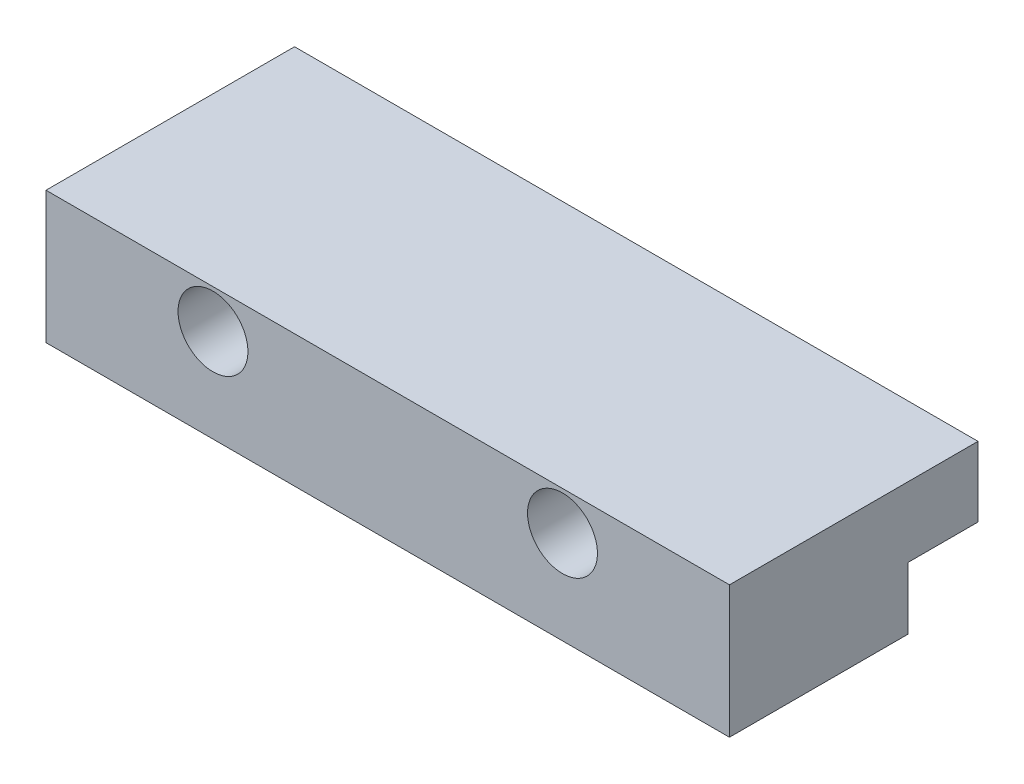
ISO-10303-21;
HEADER;
FILE_DESCRIPTION(('STEP AP214'),'2;1');
FILE_NAME('part.step','',(''),(''),'','','');
FILE_SCHEMA(('AUTOMOTIVE_DESIGN { 1 0 10303 214 1 1 1 1 }'));
ENDSEC;
DATA;
#1=APPLICATION_CONTEXT('core data for automotive mechanical design processes');
#2=APPLICATION_PROTOCOL_DEFINITION('international standard','automotive_design',2000,#1);
#3=PRODUCT_CONTEXT('',#1,'mechanical');
#4=PRODUCT('Part','Part','',(#3));
#5=PRODUCT_RELATED_PRODUCT_CATEGORY('part','',(#4));
#6=PRODUCT_DEFINITION_FORMATION('','',#4);
#7=PRODUCT_DEFINITION_CONTEXT('part definition',#1,'design');
#8=PRODUCT_DEFINITION('design','',#6,#7);
#9=PRODUCT_DEFINITION_SHAPE('','',#8);
#10=(LENGTH_UNIT() NAMED_UNIT(*) SI_UNIT(.MILLI.,.METRE.));
#11=(NAMED_UNIT(*) PLANE_ANGLE_UNIT() SI_UNIT($,.RADIAN.));
#12=(NAMED_UNIT(*) SI_UNIT($,.STERADIAN.) SOLID_ANGLE_UNIT());
#13=UNCERTAINTY_MEASURE_WITH_UNIT(LENGTH_MEASURE(1.E-05),#10,'distance_accuracy_value','');
#14=(GEOMETRIC_REPRESENTATION_CONTEXT(3) GLOBAL_UNCERTAINTY_ASSIGNED_CONTEXT((#13)) GLOBAL_UNIT_ASSIGNED_CONTEXT((#10,
#11,#12)) REPRESENTATION_CONTEXT('',''));
#15=CARTESIAN_POINT('',(0.,0.,0.));
#16=DIRECTION('',(0.,0.,1.));
#17=DIRECTION('',(1.,0.,0.));
#18=AXIS2_PLACEMENT_3D('',#15,#16,#17);
#19=CARTESIAN_POINT('',(-110.,81.25,-40.));
#20=DIRECTION('',(-1.,0.,0.));
#21=DIRECTION('',(0.,-1.,0.));
#22=AXIS2_PLACEMENT_3D('',#19,#20,#21);
#23=PLANE('',#22);
#24=DIRECTION('',(0.,0.,1.));
#25=VECTOR('',#24,1.);
#26=CARTESIAN_POINT('',(-110.000000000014,-21.85,-2.));
#27=LINE('',#26,#25);
#28=CARTESIAN_POINT('',(-110.000000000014,-21.85,-25.));
#29=VERTEX_POINT('',#28);
#30=CARTESIAN_POINT('',(-110.000000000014,-21.85,-2.));
#31=VERTEX_POINT('',#30);
#32=EDGE_CURVE('E97',#29,#31,#27,.T.);
#33=ORIENTED_EDGE('',*,*,#32,.F.);
#34=DIRECTION('',(0.,-1.,0.));
#35=VECTOR('',#34,1.);
#36=CARTESIAN_POINT('',(-110.000000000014,-23.8500000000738,-25.));
#37=LINE('',#36,#35);
#38=CARTESIAN_POINT('',(-110.000000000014,-13.8500000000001,-25.));
#39=VERTEX_POINT('',#38);
#40=EDGE_CURVE('E24',#39,#29,#37,.T.);
#41=ORIENTED_EDGE('',*,*,#40,.F.);
#42=DIRECTION('',(0.,0.,1.));
#43=VECTOR('',#42,1.);
#44=CARTESIAN_POINT('',(-110.000000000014,-13.8500000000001,-25.));
#45=LINE('',#44,#43);
#46=CARTESIAN_POINT('',(-110.000000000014,-13.8500000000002,-34.));
#47=VERTEX_POINT('',#46);
#48=EDGE_CURVE('E100',#47,#39,#45,.T.);
#49=ORIENTED_EDGE('',*,*,#48,.F.);
#50=DIRECTION('',(0.,-1.,0.));
#51=VECTOR('',#50,1.);
#52=CARTESIAN_POINT('',(-110.000000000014,-15.8500000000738,-34.));
#53=LINE('',#52,#51);
#54=CARTESIAN_POINT('',(-110.000000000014,-4.85000000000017,-34.));
#55=VERTEX_POINT('',#54);
#56=EDGE_CURVE('E98',#55,#47,#53,.T.);
#57=ORIENTED_EDGE('',*,*,#56,.F.);
#58=DIRECTION('',(0.,0.,-1.));
#59=VECTOR('',#58,1.);
#60=CARTESIAN_POINT('',(-110.000000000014,-4.85000000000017,-34.));
#61=LINE('',#60,#59);
#62=CARTESIAN_POINT('',(-110.000000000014,-4.85000000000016,-2.));
#63=VERTEX_POINT('',#62);
#64=EDGE_CURVE('E96',#63,#55,#61,.T.);
#65=ORIENTED_EDGE('',*,*,#64,.F.);
#66=DIRECTION('',(0.,1.,0.));
#67=VECTOR('',#66,1.);
#68=CARTESIAN_POINT('',(-110.000000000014,-3.85000000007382,-2.));
#69=LINE('',#68,#67);
#70=EDGE_CURVE('E71',#31,#63,#69,.T.);
#71=ORIENTED_EDGE('',*,*,#70,.F.);
#72=EDGE_LOOP('',(#33,#41,#49,#57,#65,#71));
#73=FACE_BOUND('',#72,.T.);
#74=ADVANCED_FACE('F16',(#73),#23,.F.);
#75=CARTESIAN_POINT('',(494802.,-13.8500000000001,-25.));
#76=DIRECTION('',(0.,1.,0.));
#77=DIRECTION('',(0.,0.,1.));
#78=AXIS2_PLACEMENT_3D('',#75,#76,#77);
#79=PLANE('',#78);
#80=DIRECTION('',(-1.,0.,0.));
#81=VECTOR('',#80,1.);
#82=CARTESIAN_POINT('',(494802.,-13.8500000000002,-34.));
#83=LINE('',#82,#81);
#84=CARTESIAN_POINT('',(-198.,-13.8500000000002,-34.));
#85=VERTEX_POINT('',#84);
#86=EDGE_CURVE('E128',#47,#85,#83,.T.);
#87=ORIENTED_EDGE('',*,*,#86,.F.);
#88=ORIENTED_EDGE('',*,*,#48,.T.);
#89=DIRECTION('',(-1.,0.,0.));
#90=VECTOR('',#89,1.);
#91=CARTESIAN_POINT('',(494802.,-13.8500000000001,-25.));
#92=LINE('',#91,#90);
#93=CARTESIAN_POINT('',(-198.,-13.8500000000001,-25.));
#94=VERTEX_POINT('',#93);
#95=EDGE_CURVE('E132',#39,#94,#92,.T.);
#96=ORIENTED_EDGE('',*,*,#95,.T.);
#97=DIRECTION('',(0.,0.,-1.));
#98=VECTOR('',#97,1.);
#99=CARTESIAN_POINT('',(-198.,-13.8500000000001,-25.));
#100=LINE('',#99,#98);
#101=EDGE_CURVE('E134',#94,#85,#100,.T.);
#102=ORIENTED_EDGE('',*,*,#101,.T.);
#103=EDGE_LOOP('',(#87,#88,#96,#102));
#104=FACE_BOUND('',#103,.T.);
#105=ADVANCED_FACE('F18',(#104),#79,.F.);
#106=CARTESIAN_POINT('',(494802.,-15.85,-34.));
#107=DIRECTION('',(0.,0.,1.));
#108=DIRECTION('',(1.,0.,0.));
#109=AXIS2_PLACEMENT_3D('',#106,#107,#108);
#110=PLANE('',#109);
#111=CARTESIAN_POINT('',(-176.5,-9.85000000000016,-34.));
#112=DIRECTION('',(0.,0.,1.));
#113=DIRECTION('',(1.,0.,0.));
#114=AXIS2_PLACEMENT_3D('',#111,#112,#113);
#115=CIRCLE('',#114,2.75);
#116=CARTESIAN_POINT('',(-173.75,-9.85000000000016,-34.));
#117=VERTEX_POINT('',#116);
#118=EDGE_CURVE('E113',#117,#117,#115,.T.);
#119=ORIENTED_EDGE('',*,*,#118,.T.);
#120=EDGE_LOOP('',(#119));
#121=FACE_BOUND('',#120,.T.);
#122=CARTESIAN_POINT('',(-131.5,-9.85000000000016,-34.));
#123=DIRECTION('',(0.,0.,1.));
#124=DIRECTION('',(1.,0.,0.));
#125=AXIS2_PLACEMENT_3D('',#122,#123,#124);
#126=CIRCLE('',#125,2.75);
#127=CARTESIAN_POINT('',(-128.75,-9.85000000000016,-34.));
#128=VERTEX_POINT('',#127);
#129=EDGE_CURVE('E105',#128,#128,#126,.T.);
#130=ORIENTED_EDGE('',*,*,#129,.T.);
#131=EDGE_LOOP('',(#130));
#132=FACE_BOUND('',#131,.T.);
#133=DIRECTION('',(-1.,0.,0.));
#134=VECTOR('',#133,1.);
#135=CARTESIAN_POINT('',(494802.,-4.85000000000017,-34.));
#136=LINE('',#135,#134);
#137=CARTESIAN_POINT('',(-198.,-4.85000000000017,-34.));
#138=VERTEX_POINT('',#137);
#139=EDGE_CURVE('E74',#55,#138,#136,.T.);
#140=ORIENTED_EDGE('',*,*,#139,.F.);
#141=ORIENTED_EDGE('',*,*,#56,.T.);
#142=ORIENTED_EDGE('',*,*,#86,.T.);
#143=DIRECTION('',(0.,1.,0.));
#144=VECTOR('',#143,1.);
#145=CARTESIAN_POINT('',(-198.,-15.85,-34.));
#146=LINE('',#145,#144);
#147=EDGE_CURVE('E84',#85,#138,#146,.T.);
#148=ORIENTED_EDGE('',*,*,#147,.T.);
#149=EDGE_LOOP('',(#140,#141,#142,#148));
#150=FACE_BOUND('',#149,.T.);
#151=ADVANCED_FACE('F149',(#121,#132,#150),#110,.F.);
#152=CARTESIAN_POINT('',(494802.,-4.85000000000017,-34.));
#153=DIRECTION('',(0.,-1.,0.));
#154=DIRECTION('',(0.,0.,-1.));
#155=AXIS2_PLACEMENT_3D('',#152,#153,#154);
#156=PLANE('',#155);
#157=DIRECTION('',(-1.,0.,0.));
#158=VECTOR('',#157,1.);
#159=CARTESIAN_POINT('',(494802.,-4.85000000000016,-2.));
#160=LINE('',#159,#158);
#161=CARTESIAN_POINT('',(-198.,-4.85000000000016,-2.));
#162=VERTEX_POINT('',#161);
#163=EDGE_CURVE('E64',#63,#162,#160,.T.);
#164=ORIENTED_EDGE('',*,*,#163,.F.);
#165=ORIENTED_EDGE('',*,*,#64,.T.);
#166=ORIENTED_EDGE('',*,*,#139,.T.);
#167=DIRECTION('',(0.,0.,1.));
#168=VECTOR('',#167,1.);
#169=CARTESIAN_POINT('',(-198.,-4.85000000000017,-34.));
#170=LINE('',#169,#168);
#171=EDGE_CURVE('E78',#138,#162,#170,.T.);
#172=ORIENTED_EDGE('',*,*,#171,.T.);
#173=EDGE_LOOP('',(#164,#165,#166,#172));
#174=FACE_BOUND('',#173,.T.);
#175=ADVANCED_FACE('F79',(#174),#156,.F.);
#176=CARTESIAN_POINT('',(-198.,-15.85,-25.));
#177=DIRECTION('',(-1.,0.,0.));
#178=DIRECTION('',(0.,0.,1.));
#179=AXIS2_PLACEMENT_3D('',#176,#177,#178);
#180=PLANE('',#179);
#181=DIRECTION('',(0.,1.,0.));
#182=VECTOR('',#181,1.);
#183=CARTESIAN_POINT('',(-198.,-23.85,-25.));
#184=LINE('',#183,#182);
#185=CARTESIAN_POINT('',(-198.,-21.85,-25.));
#186=VERTEX_POINT('',#185);
#187=EDGE_CURVE('E109',#186,#94,#184,.T.);
#188=ORIENTED_EDGE('',*,*,#187,.F.);
#189=DIRECTION('',(0.,0.,-1.));
#190=VECTOR('',#189,1.);
#191=CARTESIAN_POINT('',(-198.,-21.85,-2.));
#192=LINE('',#191,#190);
#193=CARTESIAN_POINT('',(-198.,-21.85,-2.));
#194=VERTEX_POINT('',#193);
#195=EDGE_CURVE('E88',#194,#186,#192,.T.);
#196=ORIENTED_EDGE('',*,*,#195,.F.);
#197=DIRECTION('',(0.,-1.,0.));
#198=VECTOR('',#197,1.);
#199=CARTESIAN_POINT('',(-198.,-3.85000000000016,-2.));
#200=LINE('',#199,#198);
#201=EDGE_CURVE('E69',#162,#194,#200,.T.);
#202=ORIENTED_EDGE('',*,*,#201,.F.);
#203=ORIENTED_EDGE('',*,*,#171,.F.);
#204=ORIENTED_EDGE('',*,*,#147,.F.);
#205=ORIENTED_EDGE('',*,*,#101,.F.);
#206=EDGE_LOOP('',(#188,#196,#202,#203,#204,#205));
#207=FACE_BOUND('',#206,.T.);
#208=ADVANCED_FACE('F87',(#207),#180,.T.);
#209=CARTESIAN_POINT('',(494802.,-3.85000000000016,-2.));
#210=DIRECTION('',(0.,0.,-1.));
#211=DIRECTION('',(-1.,0.,0.));
#212=AXIS2_PLACEMENT_3D('',#209,#210,#211);
#213=PLANE('',#212);
#214=CARTESIAN_POINT('',(-176.5,-9.85000000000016,-2.));
#215=DIRECTION('',(0.,0.,-1.));
#216=DIRECTION('',(-1.,0.,0.));
#217=AXIS2_PLACEMENT_3D('',#214,#215,#216);
#218=CIRCLE('',#217,4.5);
#219=CARTESIAN_POINT('',(-181.,-9.85000000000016,-2.));
#220=VERTEX_POINT('',#219);
#221=EDGE_CURVE('E124',#220,#220,#218,.T.);
#222=ORIENTED_EDGE('',*,*,#221,.T.);
#223=EDGE_LOOP('',(#222));
#224=FACE_BOUND('',#223,.T.);
#225=CARTESIAN_POINT('',(-131.5,-9.85000000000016,-2.));
#226=DIRECTION('',(0.,0.,-1.));
#227=DIRECTION('',(-1.,0.,0.));
#228=AXIS2_PLACEMENT_3D('',#225,#226,#227);
#229=CIRCLE('',#228,4.5);
#230=CARTESIAN_POINT('',(-136.,-9.85000000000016,-2.));
#231=VERTEX_POINT('',#230);
#232=EDGE_CURVE('E117',#231,#231,#229,.T.);
#233=ORIENTED_EDGE('',*,*,#232,.T.);
#234=EDGE_LOOP('',(#233));
#235=FACE_BOUND('',#234,.T.);
#236=DIRECTION('',(-1.,0.,0.));
#237=VECTOR('',#236,1.);
#238=CARTESIAN_POINT('',(494802.,-21.85,-2.));
#239=LINE('',#238,#237);
#240=EDGE_CURVE('E75',#31,#194,#239,.T.);
#241=ORIENTED_EDGE('',*,*,#240,.F.);
#242=ORIENTED_EDGE('',*,*,#70,.T.);
#243=ORIENTED_EDGE('',*,*,#163,.T.);
#244=ORIENTED_EDGE('',*,*,#201,.T.);
#245=EDGE_LOOP('',(#241,#242,#243,#244));
#246=FACE_BOUND('',#245,.T.);
#247=ADVANCED_FACE('F67',(#224,#235,#246),#213,.F.);
#248=CARTESIAN_POINT('',(494802.,-23.85,-25.));
#249=DIRECTION('',(0.,0.,1.));
#250=DIRECTION('',(1.,0.,0.));
#251=AXIS2_PLACEMENT_3D('',#248,#249,#250);
#252=PLANE('',#251);
#253=ORIENTED_EDGE('',*,*,#40,.T.);
#254=DIRECTION('',(-1.,0.,0.));
#255=VECTOR('',#254,1.);
#256=CARTESIAN_POINT('',(494802.,-21.85,-25.));
#257=LINE('',#256,#255);
#258=EDGE_CURVE('E11',#29,#186,#257,.T.);
#259=ORIENTED_EDGE('',*,*,#258,.T.);
#260=ORIENTED_EDGE('',*,*,#187,.T.);
#261=ORIENTED_EDGE('',*,*,#95,.F.);
#262=EDGE_LOOP('',(#253,#259,#260,#261));
#263=FACE_BOUND('',#262,.T.);
#264=ADVANCED_FACE('F146',(#263),#252,.F.);
#265=CARTESIAN_POINT('',(494802.,-21.85,-2.));
#266=DIRECTION('',(0.,1.,0.));
#267=DIRECTION('',(0.,0.,1.));
#268=AXIS2_PLACEMENT_3D('',#265,#266,#267);
#269=PLANE('',#268);
#270=ORIENTED_EDGE('',*,*,#258,.F.);
#271=ORIENTED_EDGE('',*,*,#32,.T.);
#272=ORIENTED_EDGE('',*,*,#240,.T.);
#273=ORIENTED_EDGE('',*,*,#195,.T.);
#274=EDGE_LOOP('',(#270,#271,#272,#273));
#275=FACE_BOUND('',#274,.T.);
#276=ADVANCED_FACE('F150',(#275),#269,.F.);
#277=CARTESIAN_POINT('',(-131.5,-9.85000000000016,-65.445442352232));
#278=DIRECTION('',(0.,0.,-1.));
#279=DIRECTION('',(-1.,0.,0.));
#280=AXIS2_PLACEMENT_3D('',#277,#278,#279);
#281=CYLINDRICAL_SURFACE('',#280,2.75);
#282=CARTESIAN_POINT('',(-131.5,-9.85000000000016,-22.));
#283=DIRECTION('',(0.,0.,-1.));
#284=DIRECTION('',(-1.,0.,0.));
#285=AXIS2_PLACEMENT_3D('',#282,#283,#284);
#286=CIRCLE('',#285,2.75);
#287=CARTESIAN_POINT('',(-134.25,-9.85000000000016,-22.));
#288=VERTEX_POINT('',#287);
#289=EDGE_CURVE('E102',#288,#288,#286,.T.);
#290=ORIENTED_EDGE('',*,*,#289,.F.);
#291=EDGE_LOOP('',(#290));
#292=FACE_BOUND('',#291,.T.);
#293=ORIENTED_EDGE('',*,*,#129,.F.);
#294=EDGE_LOOP('',(#293));
#295=FACE_BOUND('',#294,.T.);
#296=ADVANCED_FACE('F152',(#292,#295),#281,.F.);
#297=CARTESIAN_POINT('',(-131.5,-9.85000000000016,-22.));
#298=DIRECTION('',(0.,0.,-1.));
#299=DIRECTION('',(-1.,0.,0.));
#300=AXIS2_PLACEMENT_3D('',#297,#298,#299);
#301=PLANE('',#300);
#302=ORIENTED_EDGE('',*,*,#289,.T.);
#303=EDGE_LOOP('',(#302));
#304=FACE_BOUND('',#303,.T.);
#305=CARTESIAN_POINT('',(-131.5,-9.85000000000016,-22.));
#306=DIRECTION('',(0.,0.,-1.));
#307=DIRECTION('',(-1.,0.,0.));
#308=AXIS2_PLACEMENT_3D('',#305,#306,#307);
#309=CIRCLE('',#308,4.5);
#310=CARTESIAN_POINT('',(-136.,-9.85000000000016,-22.));
#311=VERTEX_POINT('',#310);
#312=EDGE_CURVE('E106',#311,#311,#309,.T.);
#313=ORIENTED_EDGE('',*,*,#312,.F.);
#314=EDGE_LOOP('',(#313));
#315=FACE_BOUND('',#314,.T.);
#316=ADVANCED_FACE('F158',(#304,#315),#301,.F.);
#317=CARTESIAN_POINT('',(-131.5,-9.85000000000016,-2.));
#318=DIRECTION('',(0.,0.,-1.));
#319=DIRECTION('',(-1.,0.,0.));
#320=AXIS2_PLACEMENT_3D('',#317,#318,#319);
#321=CYLINDRICAL_SURFACE('',#320,4.5);
#322=ORIENTED_EDGE('',*,*,#312,.T.);
#323=EDGE_LOOP('',(#322));
#324=FACE_BOUND('',#323,.T.);
#325=ORIENTED_EDGE('',*,*,#232,.F.);
#326=EDGE_LOOP('',(#325));
#327=FACE_BOUND('',#326,.T.);
#328=ADVANCED_FACE('F174',(#324,#327),#321,.F.);
#329=CARTESIAN_POINT('',(-176.5,-9.85000000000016,-65.4454423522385));
#330=DIRECTION('',(0.,0.,-1.));
#331=DIRECTION('',(-1.,0.,0.));
#332=AXIS2_PLACEMENT_3D('',#329,#330,#331);
#333=CYLINDRICAL_SURFACE('',#332,2.75);
#334=CARTESIAN_POINT('',(-176.5,-9.85000000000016,-22.));
#335=DIRECTION('',(0.,0.,-1.));
#336=DIRECTION('',(-1.,0.,0.));
#337=AXIS2_PLACEMENT_3D('',#334,#335,#336);
#338=CIRCLE('',#337,2.75);
#339=CARTESIAN_POINT('',(-179.25,-9.85000000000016,-22.));
#340=VERTEX_POINT('',#339);
#341=EDGE_CURVE('E110',#340,#340,#338,.T.);
#342=ORIENTED_EDGE('',*,*,#341,.F.);
#343=EDGE_LOOP('',(#342));
#344=FACE_BOUND('',#343,.T.);
#345=ORIENTED_EDGE('',*,*,#118,.F.);
#346=EDGE_LOOP('',(#345));
#347=FACE_BOUND('',#346,.T.);
#348=ADVANCED_FACE('F170',(#344,#347),#333,.F.);
#349=CARTESIAN_POINT('',(-176.5,-9.85000000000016,-22.));
#350=DIRECTION('',(0.,0.,-1.));
#351=DIRECTION('',(-1.,0.,0.));
#352=AXIS2_PLACEMENT_3D('',#349,#350,#351);
#353=PLANE('',#352);
#354=ORIENTED_EDGE('',*,*,#341,.T.);
#355=EDGE_LOOP('',(#354));
#356=FACE_BOUND('',#355,.T.);
#357=CARTESIAN_POINT('',(-176.5,-9.85000000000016,-22.));
#358=DIRECTION('',(0.,0.,-1.));
#359=DIRECTION('',(-1.,0.,0.));
#360=AXIS2_PLACEMENT_3D('',#357,#358,#359);
#361=CIRCLE('',#360,4.5);
#362=CARTESIAN_POINT('',(-181.,-9.85000000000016,-22.));
#363=VERTEX_POINT('',#362);
#364=EDGE_CURVE('E114',#363,#363,#361,.T.);
#365=ORIENTED_EDGE('',*,*,#364,.F.);
#366=EDGE_LOOP('',(#365));
#367=FACE_BOUND('',#366,.T.);
#368=ADVANCED_FACE('F173',(#356,#367),#353,.F.);
#369=CARTESIAN_POINT('',(-176.5,-9.85000000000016,-2.));
#370=DIRECTION('',(0.,0.,-1.));
#371=DIRECTION('',(-1.,0.,0.));
#372=AXIS2_PLACEMENT_3D('',#369,#370,#371);
#373=CYLINDRICAL_SURFACE('',#372,4.5);
#374=ORIENTED_EDGE('',*,*,#364,.T.);
#375=EDGE_LOOP('',(#374));
#376=FACE_BOUND('',#375,.T.);
#377=ORIENTED_EDGE('',*,*,#221,.F.);
#378=EDGE_LOOP('',(#377));
#379=FACE_BOUND('',#378,.T.);
#380=ADVANCED_FACE('F179',(#376,#379),#373,.F.);
#381=CLOSED_SHELL('',(#74,#105,#151,#175,#208,#247,#264,#276,#296,#316,#328,#348,#368,#380));
#382=MANIFOLD_SOLID_BREP('B1',#381);
#383=ADVANCED_BREP_SHAPE_REPRESENTATION('',(#18,#382),#14);
#384=SHAPE_DEFINITION_REPRESENTATION(#9,#383);
ENDSEC;
END-ISO-10303-21;
